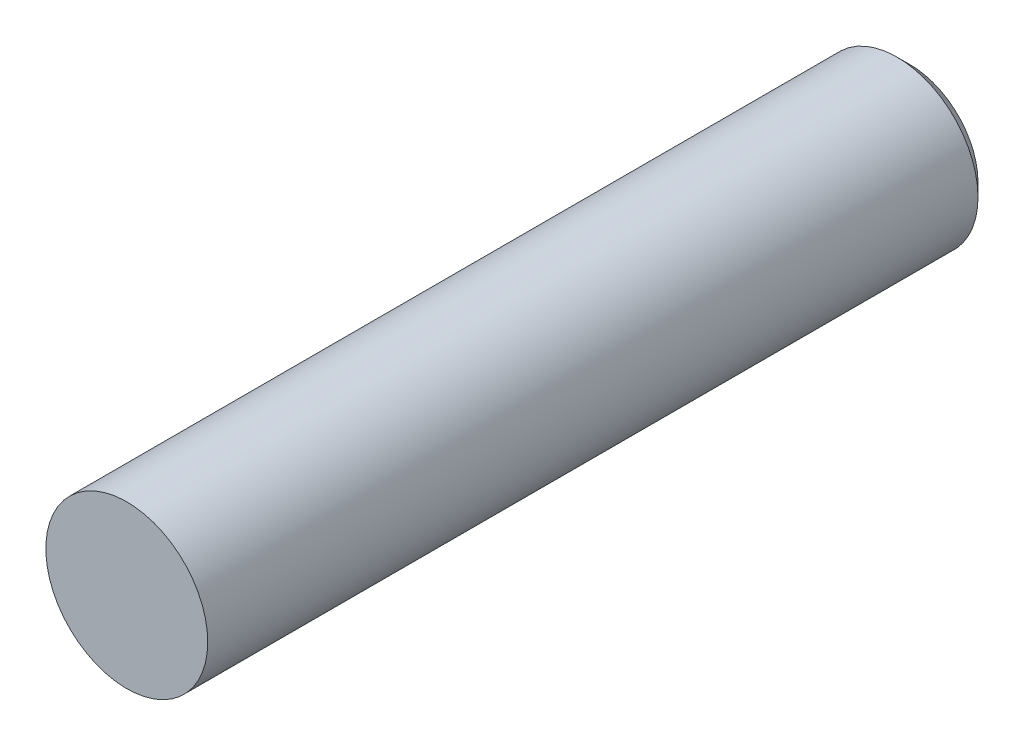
from build123d import *

# Parameters (mm, degrees)
ESQUISSE1_R      = 3.1
EXTRUSION1_DEPTH = 30
CHANFREIN2_SIZE  = 0.5


with BuildPart() as part:
    # Esquisse1 → Extrusion1 (new body)
    with BuildSketch(Plane.XY):
        Circle(ESQUISSE1_R)
    extrude(amount=EXTRUSION1_DEPTH)

    # Chanfrein2
    chanfrein2_edges = [part.edges().sort_by_distance(p)[0] for p in [
        (-3.1, 0, 0),
    ]]
    chamfer(chanfrein2_edges, length=CHANFREIN2_SIZE)


solid = part.part
